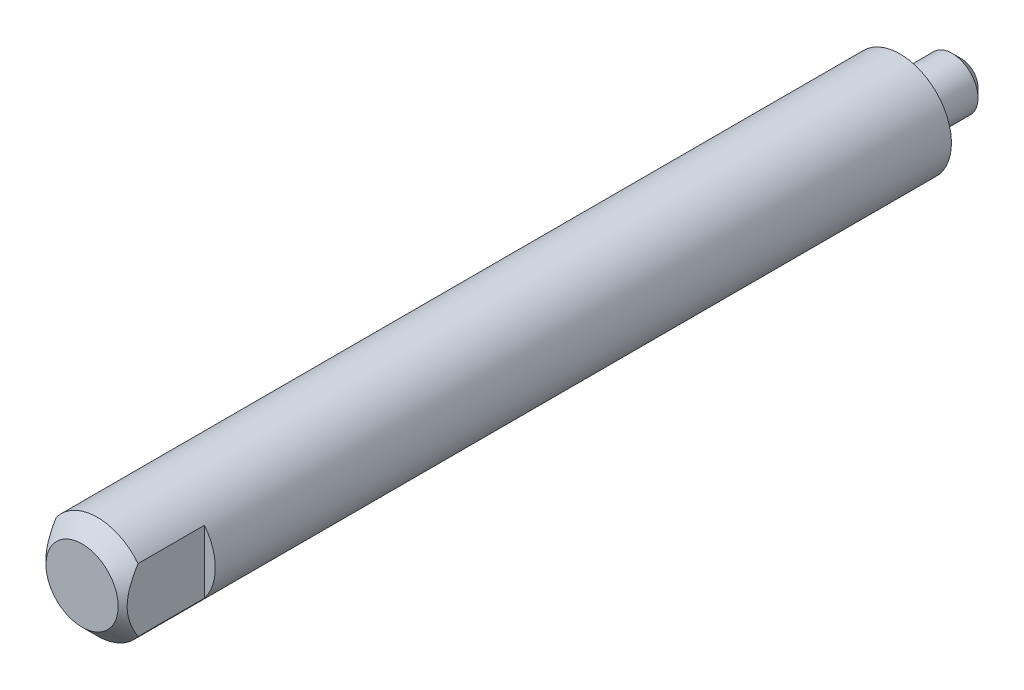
ISO-10303-21;
HEADER;
FILE_DESCRIPTION(('STEP AP214'),'2;1');
FILE_NAME('part.step','',(''),(''),'','','');
FILE_SCHEMA(('AUTOMOTIVE_DESIGN { 1 0 10303 214 1 1 1 1 }'));
ENDSEC;
DATA;
#1=APPLICATION_CONTEXT('core data for automotive mechanical design processes');
#2=APPLICATION_PROTOCOL_DEFINITION('international standard','automotive_design',2000,#1);
#3=PRODUCT_CONTEXT('',#1,'mechanical');
#4=PRODUCT('Part','Part','',(#3));
#5=PRODUCT_RELATED_PRODUCT_CATEGORY('part','',(#4));
#6=PRODUCT_DEFINITION_FORMATION('','',#4);
#7=PRODUCT_DEFINITION_CONTEXT('part definition',#1,'design');
#8=PRODUCT_DEFINITION('design','',#6,#7);
#9=PRODUCT_DEFINITION_SHAPE('','',#8);
#10=(LENGTH_UNIT() NAMED_UNIT(*) SI_UNIT(.MILLI.,.METRE.));
#11=(NAMED_UNIT(*) PLANE_ANGLE_UNIT() SI_UNIT($,.RADIAN.));
#12=(NAMED_UNIT(*) SI_UNIT($,.STERADIAN.) SOLID_ANGLE_UNIT());
#13=UNCERTAINTY_MEASURE_WITH_UNIT(LENGTH_MEASURE(1.E-05),#10,'distance_accuracy_value','');
#14=(GEOMETRIC_REPRESENTATION_CONTEXT(3) GLOBAL_UNCERTAINTY_ASSIGNED_CONTEXT((#13)) GLOBAL_UNIT_ASSIGNED_CONTEXT((#10,
#11,#12)) REPRESENTATION_CONTEXT('',''));
#15=CARTESIAN_POINT('',(0.,0.,0.));
#16=DIRECTION('',(0.,0.,1.));
#17=DIRECTION('',(1.,0.,0.));
#18=AXIS2_PLACEMENT_3D('',#15,#16,#17);
#19=CARTESIAN_POINT('',(0.0303893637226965,0.,80.));
#20=DIRECTION('',(0.,0.,-1.));
#21=DIRECTION('',(0.,-1.,0.));
#22=AXIS2_PLACEMENT_3D('',#19,#20,#21);
#23=CONICAL_SURFACE('',#22,3.5303893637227,0.78539816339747);
#24=CARTESIAN_POINT('',(0.0303893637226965,0.,80.));
#25=DIRECTION('',(0.,0.,-1.));
#26=DIRECTION('',(0.,-1.,0.));
#27=AXIS2_PLACEMENT_3D('',#24,#25,#26);
#28=CIRCLE('',#27,3.5303893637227);
#29=CARTESIAN_POINT('',(0.0303893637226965,-3.5303893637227,80.));
#30=VERTEX_POINT('',#29);
#31=EDGE_CURVE('E112',#30,#30,#28,.T.);
#32=ORIENTED_EDGE('',*,*,#31,.T.);
#33=EDGE_LOOP('',(#32));
#34=FACE_BOUND('',#33,.T.);
#35=CARTESIAN_POINT('',(4.,7.33813034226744,75.1873703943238));
#36=CARTESIAN_POINT('',(4.,7.16528585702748,75.3393697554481));
#37=CARTESIAN_POINT('',(4.,6.9918602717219,75.4907153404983));
#38=CARTESIAN_POINT('',(4.,6.64353602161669,75.7917470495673));
#39=CARTESIAN_POINT('',(4.,6.46863716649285,75.9414329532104));
#40=CARTESIAN_POINT('',(4.,6.11613508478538,76.2395700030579));
#41=CARTESIAN_POINT('',(4.,5.93852227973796,76.3880098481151));
#42=CARTESIAN_POINT('',(4.,5.58115163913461,76.6822677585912));
#43=CARTESIAN_POINT('',(4.,5.40139393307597,76.8280859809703));
#44=CARTESIAN_POINT('',(4.,5.0262482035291,77.126705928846));
#45=CARTESIAN_POINT('',(4.,4.83066252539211,77.2792602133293));
#46=CARTESIAN_POINT('',(4.,4.435561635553,77.5792996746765));
#47=CARTESIAN_POINT('',(4.,4.23604568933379,77.7267838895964));
#48=CARTESIAN_POINT('',(4.,3.83248423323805,78.0144361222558));
#49=CARTESIAN_POINT('',(4.,3.62845042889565,78.1546204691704));
#50=CARTESIAN_POINT('',(4.,3.21402508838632,78.4251895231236));
#51=CARTESIAN_POINT('',(4.,3.00363658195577,78.555578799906));
#52=CARTESIAN_POINT('',(4.,2.64334730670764,78.7626930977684));
#53=CARTESIAN_POINT('',(4.,2.49565075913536,78.8432321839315));
#54=CARTESIAN_POINT('',(4.,2.1958076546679,78.9957779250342));
#55=CARTESIAN_POINT('',(4.,2.04365981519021,79.0677820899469));
#56=CARTESIAN_POINT('',(4.,1.73620810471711,79.1998951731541));
#57=CARTESIAN_POINT('',(4.,1.58095751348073,79.2601264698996));
#58=CARTESIAN_POINT('',(4.,1.26569016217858,79.3665170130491));
#59=CARTESIAN_POINT('',(4.,1.10567636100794,79.4126848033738));
#60=CARTESIAN_POINT('',(4.,0.827710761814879,79.476973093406));
#61=CARTESIAN_POINT('',(4.,0.710741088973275,79.4993361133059));
#62=CARTESIAN_POINT('',(4.,0.475325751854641,79.5341149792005));
#63=CARTESIAN_POINT('',(4.,0.356880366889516,79.5465326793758));
#64=CARTESIAN_POINT('',(4.,0.119558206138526,79.5607419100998));
#65=CARTESIAN_POINT('',(4.,0.000682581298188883,79.5625524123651));
#66=CARTESIAN_POINT('',(4.,-0.236754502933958,79.5554960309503));
#67=CARTESIAN_POINT('',(4.,-0.355315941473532,79.5466284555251));
#68=CARTESIAN_POINT('',(4.,-0.590194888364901,79.5188251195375));
#69=CARTESIAN_POINT('',(4.,-0.706522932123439,79.4999769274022));
#70=CARTESIAN_POINT('',(4.,-0.937319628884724,79.4531848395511));
#71=CARTESIAN_POINT('',(4.,-1.05178812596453,79.425240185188));
#72=CARTESIAN_POINT('',(4.,-1.27960221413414,79.3610830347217));
#73=CARTESIAN_POINT('',(4.,-1.39292493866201,79.3247902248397));
#74=CARTESIAN_POINT('',(4.,-1.61707609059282,79.2453265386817));
#75=CARTESIAN_POINT('',(4.,-1.72790506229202,79.202157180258));
#76=CARTESIAN_POINT('',(4.,-2.01082785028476,79.0833159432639));
#77=CARTESIAN_POINT('',(4.,-2.18110670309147,79.0033319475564));
#78=CARTESIAN_POINT('',(4.,-2.51626466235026,78.8326686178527));
#79=CARTESIAN_POINT('',(4.,-2.68113979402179,78.7419816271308));
#80=CARTESIAN_POINT('',(4.,-3.00688630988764,78.5522790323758));
#81=CARTESIAN_POINT('',(4.,-3.16773873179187,78.4532311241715));
#82=CARTESIAN_POINT('',(4.,-3.48549889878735,78.2491304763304));
#83=CARTESIAN_POINT('',(4.,-3.64240766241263,78.1440793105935));
#84=CARTESIAN_POINT('',(4.,-3.94420672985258,77.9354467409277));
#85=CARTESIAN_POINT('',(4.,-4.08927393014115,77.8321199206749));
#86=CARTESIAN_POINT('',(4.,-4.3770427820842,77.622205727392));
#87=CARTESIAN_POINT('',(4.,-4.51974421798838,77.5156180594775));
#88=CARTESIAN_POINT('',(4.,-4.80180621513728,77.3008747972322));
#89=CARTESIAN_POINT('',(4.,-4.94118567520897,77.1927439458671));
#90=CARTESIAN_POINT('',(4.,-5.21825792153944,76.9744112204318));
#91=CARTESIAN_POINT('',(4.,-5.35595112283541,76.8642098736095));
#92=CARTESIAN_POINT('',(4.,-5.49296670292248,76.7531855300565));
#93=B_SPLINE_CURVE_WITH_KNOTS('',3,(#35,#36,#37,#38,#39,#40,#41,#42,#43,#44,#45,#46,#47,#48,#49,
#50,#51,#52,#53,#54,#55,#56,#57,#58,#59,#60,#61,#62,#63,#64,#65,#66,#67,#68,#69,#70,#71,#72,#73,
#74,#75,#76,#77,#78,#79,#80,#81,#82,#83,#84,#85,#86,#87,#88,#89,#90,#91,#92),.UNSPECIFIED.,.F.,
.F.,(4,2,2,2,2,2,2,2,2,2,2,2,2,2,2,2,2,2,2,2,2,2,2,2,2,2,2,2,4),(0.,0.690520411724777,
1.38113143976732,2.07553650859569,2.76989986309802,3.51397533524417,4.25819121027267,
5.00066372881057,5.74278767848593,6.24726681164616,6.75189276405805,7.25095592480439,
7.74971528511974,8.10660603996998,8.46343024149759,8.81961604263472,9.17582491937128,
9.52895903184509,9.88212260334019,10.2388375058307,10.5954737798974,11.1593067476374,
11.7235455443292,12.2900740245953,12.8564546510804,13.3907111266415,13.925016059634,
14.4542112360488,14.9832734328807),.UNSPECIFIED.);
#94=CARTESIAN_POINT('',(4.,3.08982338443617,78.5));
#95=VERTEX_POINT('',#94);
#96=CARTESIAN_POINT('',(4.,-3.08982338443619,78.5));
#97=VERTEX_POINT('',#96);
#98=EDGE_CURVE('E64',#95,#97,#93,.T.);
#99=ORIENTED_EDGE('',*,*,#98,.F.);
#100=CARTESIAN_POINT('',(0.0303893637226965,0.,78.5));
#101=DIRECTION('',(0.,0.,-1.));
#102=DIRECTION('',(0.,-1.,0.));
#103=AXIS2_PLACEMENT_3D('',#100,#101,#102);
#104=CIRCLE('',#103,5.03038936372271);
#105=CARTESIAN_POINT('',(-4.,3.0101127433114,78.5));
#106=VERTEX_POINT('',#105);
#107=EDGE_CURVE('E110',#106,#95,#104,.T.);
#108=ORIENTED_EDGE('',*,*,#107,.F.);
#109=CARTESIAN_POINT('',(-4.,7.36644510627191,75.1334523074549));
#110=CARTESIAN_POINT('',(-4.,7.19226264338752,75.2862313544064));
#111=CARTESIAN_POINT('',(-4.,7.01748363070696,75.4383376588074));
#112=CARTESIAN_POINT('',(-4.,6.66641297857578,75.7408422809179));
#113=CARTESIAN_POINT('',(-4.,6.49012113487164,75.891240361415));
#114=CARTESIAN_POINT('',(-4.,6.1347280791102,76.1907877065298));
#115=CARTESIAN_POINT('',(-4.,5.95561651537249,76.339924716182));
#116=CARTESIAN_POINT('',(-4.,5.59519131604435,76.6354958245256));
#117=CARTESIAN_POINT('',(-4.,5.41387781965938,76.7819300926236));
#118=CARTESIAN_POINT('',(-4.,5.03480962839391,77.0822145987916));
#119=CARTESIAN_POINT('',(-4.,4.83684199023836,77.2357969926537));
#120=CARTESIAN_POINT('',(-4.,4.43684562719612,77.5376941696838));
#121=CARTESIAN_POINT('',(-4.,4.23481609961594,77.6860078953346));
#122=CARTESIAN_POINT('',(-4.,3.82609576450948,77.9750140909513));
#123=CARTESIAN_POINT('',(-4.,3.61941770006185,78.1157244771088));
#124=CARTESIAN_POINT('',(-4.,3.19950883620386,78.3869335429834));
#125=CARTESIAN_POINT('',(-4.,2.98628134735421,78.5174372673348));
#126=CARTESIAN_POINT('',(-4.,2.62183643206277,78.7237843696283));
#127=CARTESIAN_POINT('',(-4.,2.47290359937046,78.8036410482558));
#128=CARTESIAN_POINT('',(-4.,2.17054389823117,78.9545703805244));
#129=CARTESIAN_POINT('',(-4.,2.01711577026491,79.0256405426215));
#130=CARTESIAN_POINT('',(-4.,1.70721835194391,79.1555652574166));
#131=CARTESIAN_POINT('',(-4.,1.55080567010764,79.2145530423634));
#132=CARTESIAN_POINT('',(-4.,1.23328290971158,79.3181952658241));
#133=CARTESIAN_POINT('',(-4.,1.07217566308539,79.3628581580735));
#134=CARTESIAN_POINT('',(-4.,0.791167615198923,79.4246941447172));
#135=CARTESIAN_POINT('',(-4.,0.672188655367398,79.4460534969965));
#136=CARTESIAN_POINT('',(-4.,0.432841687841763,79.4785562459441));
#137=CARTESIAN_POINT('',(-4.,0.312473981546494,79.4897018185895));
#138=CARTESIAN_POINT('',(-4.,0.0714376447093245,79.501161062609));
#139=CARTESIAN_POINT('',(-4.,-0.0492300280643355,79.5014945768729));
#140=CARTESIAN_POINT('',(-4.,-0.290119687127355,79.491365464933));
#141=CARTESIAN_POINT('',(-4.,-0.410341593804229,79.4809009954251));
#142=CARTESIAN_POINT('',(-4.,-0.674613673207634,79.4464489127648));
#143=CARTESIAN_POINT('',(-4.,-0.818353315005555,79.4200785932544));
#144=CARTESIAN_POINT('',(-4.,-1.10275410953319,79.3541563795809));
#145=CARTESIAN_POINT('',(-4.,-1.24341419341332,79.3145999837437));
#146=CARTESIAN_POINT('',(-4.,-1.52331578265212,79.2237997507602));
#147=CARTESIAN_POINT('',(-4.,-1.66250017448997,79.172381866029));
#148=CARTESIAN_POINT('',(-4.,-1.86841050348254,79.0884223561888));
#149=CARTESIAN_POINT('',(-4.,-1.93656399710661,79.059299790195));
#150=CARTESIAN_POINT('',(-4.,-2.07195883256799,78.9990121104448));
#151=CARTESIAN_POINT('',(-4.,-2.13920021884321,78.9678470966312));
#152=CARTESIAN_POINT('',(-4.,-2.3482787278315,78.8674660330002));
#153=CARTESIAN_POINT('',(-4.,-2.48857663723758,78.7950351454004));
#154=CARTESIAN_POINT('',(-4.,-2.76567007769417,78.6437239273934));
#155=CARTESIAN_POINT('',(-4.,-2.90246437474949,78.5648413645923));
#156=CARTESIAN_POINT('',(-4.,-3.17316533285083,78.4019079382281));
#157=CARTESIAN_POINT('',(-4.,-3.30706804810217,78.3178505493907));
#158=CARTESIAN_POINT('',(-4.,-3.57222979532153,78.1457166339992));
#159=CARTESIAN_POINT('',(-4.,-3.7034891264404,78.0576405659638));
#160=CARTESIAN_POINT('',(-4.,-3.96459211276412,77.8776888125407));
#161=CARTESIAN_POINT('',(-4.,-4.09442162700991,77.7857926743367));
#162=CARTESIAN_POINT('',(-4.,-4.3521559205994,77.5993350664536));
#163=CARTESIAN_POINT('',(-4.,-4.4800606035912,77.5047734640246));
#164=CARTESIAN_POINT('',(-4.,-4.8611399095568,77.2179721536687));
#165=CARTESIAN_POINT('',(-4.,-5.1118689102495,77.0224834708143));
#166=CARTESIAN_POINT('',(-4.,-5.57982109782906,76.6484461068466));
#167=CARTESIAN_POINT('',(-4.,-5.79756949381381,76.4705486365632));
#168=CARTESIAN_POINT('',(-4.,-6.23016750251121,76.1111896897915));
#169=CARTESIAN_POINT('',(-4.,-6.44501659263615,75.9297275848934));
#170=CARTESIAN_POINT('',(-4.,-6.8695732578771,75.5665256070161));
#171=CARTESIAN_POINT('',(-4.,-7.07931124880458,75.3848211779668));
#172=CARTESIAN_POINT('',(-4.,-7.49689745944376,75.0193668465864));
#173=CARTESIAN_POINT('',(-4.,-7.70474618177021,74.8356175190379));
#174=CARTESIAN_POINT('',(-4.,-7.91188936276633,74.6510858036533));
#175=B_SPLINE_CURVE_WITH_KNOTS('',3,(#109,#110,#111,#112,#113,#114,#115,#116,#117,#118,#119,
#120,#121,#122,#123,#124,#125,#126,#127,#128,#129,#130,#131,#132,#133,#134,#135,#136,#137,#138,
#139,#140,#141,#142,#143,#144,#145,#146,#147,#148,#149,#150,#151,#152,#153,#154,#155,#156,#157,
#158,#159,#160,#161,#162,#163,#164,#165,#166,#167,#168,#169,#170,#171,#172,#173,#174),
.UNSPECIFIED.,.F.,.F.,(4,2,2,2,2,2,2,2,2,2,2,2,2,2,2,2,2,2,2,2,2,2,2,2,2,2,2,2,2,2,2,2,4),(0.,
0.695080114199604,1.39025559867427,2.08945204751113,2.78860452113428,3.54021020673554,
4.29196591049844,5.04186515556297,5.79139139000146,6.29814904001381,6.80505006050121,
7.30601849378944,7.80669073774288,8.16894371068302,8.53111949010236,8.89263054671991,
9.25420332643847,9.69187797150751,10.1297021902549,10.5744130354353,10.7967313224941,
11.019038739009,11.4924726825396,11.9660711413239,12.4402795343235,12.914433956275,
13.3915774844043,13.8687448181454,14.8223871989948,15.6658868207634,16.5095365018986,
17.342023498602,18.174282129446),.UNSPECIFIED.);
#176=CARTESIAN_POINT('',(-4.,-3.01011274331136,78.5));
#177=VERTEX_POINT('',#176);
#178=EDGE_CURVE('E88',#177,#106,#175,.F.);
#179=ORIENTED_EDGE('',*,*,#178,.F.);
#180=EDGE_CURVE('E109',#97,#177,#104,.T.);
#181=ORIENTED_EDGE('',*,*,#180,.F.);
#182=EDGE_LOOP('',(#99,#108,#179,#181));
#183=FACE_BOUND('',#182,.T.);
#184=ADVANCED_FACE('F14',(#34,#183),#23,.T.);
#185=CARTESIAN_POINT('',(0.0303893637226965,0.,-8.08262108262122));
#186=DIRECTION('',(0.,0.,-1.));
#187=DIRECTION('',(0.,-1.,0.));
#188=AXIS2_PLACEMENT_3D('',#185,#186,#187);
#189=CYLINDRICAL_SURFACE('',#188,5.0303893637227);
#190=CARTESIAN_POINT('',(0.0303893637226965,0.,0.));
#191=DIRECTION('',(0.,0.,-1.));
#192=DIRECTION('',(0.,-1.,0.));
#193=AXIS2_PLACEMENT_3D('',#190,#191,#192);
#194=CIRCLE('',#193,5.03038936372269);
#195=CARTESIAN_POINT('',(0.0303893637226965,-5.03038936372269,0.));
#196=VERTEX_POINT('',#195);
#197=EDGE_CURVE('E106',#196,#196,#194,.T.);
#198=ORIENTED_EDGE('',*,*,#197,.F.);
#199=EDGE_LOOP('',(#198));
#200=FACE_BOUND('',#199,.T.);
#201=CARTESIAN_POINT('',(0.0303893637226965,0.,72.));
#202=DIRECTION('',(0.,0.,-1.));
#203=DIRECTION('',(0.,-1.,0.));
#204=AXIS2_PLACEMENT_3D('',#201,#202,#203);
#205=CIRCLE('',#204,5.0303893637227);
#206=CARTESIAN_POINT('',(4.,3.08982338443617,72.));
#207=VERTEX_POINT('',#206);
#208=CARTESIAN_POINT('',(4.,-3.08982338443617,72.));
#209=VERTEX_POINT('',#208);
#210=EDGE_CURVE('E22',#207,#209,#205,.T.);
#211=ORIENTED_EDGE('',*,*,#210,.T.);
#212=DIRECTION('',(0.,0.,-1.));
#213=VECTOR('',#212,1.);
#214=CARTESIAN_POINT('',(4.,-3.08982338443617,-8.08262108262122));
#215=LINE('',#214,#213);
#216=EDGE_CURVE('E9',#97,#209,#215,.T.);
#217=ORIENTED_EDGE('',*,*,#216,.F.);
#218=ORIENTED_EDGE('',*,*,#180,.T.);
#219=DIRECTION('',(0.,0.,-1.));
#220=VECTOR('',#219,1.);
#221=CARTESIAN_POINT('',(-4.,-3.01011274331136,-8.08262108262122));
#222=LINE('',#221,#220);
#223=CARTESIAN_POINT('',(-4.,-3.01011274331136,72.));
#224=VERTEX_POINT('',#223);
#225=EDGE_CURVE('E115',#224,#177,#222,.F.);
#226=ORIENTED_EDGE('',*,*,#225,.F.);
#227=CARTESIAN_POINT('',(0.0303893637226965,0.,72.));
#228=DIRECTION('',(0.,0.,1.));
#229=DIRECTION('',(0.,1.,0.));
#230=AXIS2_PLACEMENT_3D('',#227,#228,#229);
#231=CIRCLE('',#230,5.0303893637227);
#232=CARTESIAN_POINT('',(-4.,3.01011274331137,72.));
#233=VERTEX_POINT('',#232);
#234=EDGE_CURVE('E117',#233,#224,#231,.T.);
#235=ORIENTED_EDGE('',*,*,#234,.F.);
#236=DIRECTION('',(0.,0.,-1.));
#237=VECTOR('',#236,1.);
#238=CARTESIAN_POINT('',(-4.,3.01011274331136,-8.08262108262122));
#239=LINE('',#238,#237);
#240=EDGE_CURVE('E119',#106,#233,#239,.T.);
#241=ORIENTED_EDGE('',*,*,#240,.F.);
#242=ORIENTED_EDGE('',*,*,#107,.T.);
#243=DIRECTION('',(0.,0.,-1.));
#244=VECTOR('',#243,1.);
#245=CARTESIAN_POINT('',(4.,3.08982338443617,-8.08262108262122));
#246=LINE('',#245,#244);
#247=EDGE_CURVE('E60',#207,#95,#246,.F.);
#248=ORIENTED_EDGE('',*,*,#247,.F.);
#249=EDGE_LOOP('',(#211,#217,#218,#226,#235,#241,#242,#248));
#250=FACE_BOUND('',#249,.T.);
#251=ADVANCED_FACE('F57',(#200,#250),#189,.T.);
#252=CARTESIAN_POINT('',(-3.5,0.,80.));
#253=DIRECTION('',(0.,0.,-1.));
#254=DIRECTION('',(0.,-1.,0.));
#255=AXIS2_PLACEMENT_3D('',#252,#253,#254);
#256=PLANE('',#255);
#257=ORIENTED_EDGE('',*,*,#31,.F.);
#258=EDGE_LOOP('',(#257));
#259=FACE_BOUND('',#258,.T.);
#260=ADVANCED_FACE('F16',(#259),#256,.F.);
#261=CARTESIAN_POINT('',(-2.79999999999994,0.,0.));
#262=DIRECTION('',(0.,0.,1.));
#263=DIRECTION('',(0.,1.,0.));
#264=AXIS2_PLACEMENT_3D('',#261,#262,#263);
#265=PLANE('',#264);
#266=CARTESIAN_POINT('',(0.0303893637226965,0.,0.));
#267=DIRECTION('',(0.,0.,-1.));
#268=DIRECTION('',(0.,-1.,0.));
#269=AXIS2_PLACEMENT_3D('',#266,#267,#268);
#270=CIRCLE('',#269,2.83038936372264);
#271=CARTESIAN_POINT('',(0.0303893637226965,-2.83038936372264,0.));
#272=VERTEX_POINT('',#271);
#273=EDGE_CURVE('E103',#272,#272,#270,.T.);
#274=ORIENTED_EDGE('',*,*,#273,.F.);
#275=EDGE_LOOP('',(#274));
#276=FACE_BOUND('',#275,.T.);
#277=ORIENTED_EDGE('',*,*,#197,.T.);
#278=EDGE_LOOP('',(#277));
#279=FACE_BOUND('',#278,.T.);
#280=ADVANCED_FACE('F146',(#276,#279),#265,.F.);
#281=CARTESIAN_POINT('',(0.0303893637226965,0.,-0.300000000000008));
#282=DIRECTION('',(0.,0.,-1.));
#283=DIRECTION('',(0.,-1.,0.));
#284=AXIS2_PLACEMENT_3D('',#281,#282,#283);
#285=TOROIDAL_SURFACE('',#284,2.83038936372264,0.299999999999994);
#286=CARTESIAN_POINT('',(0.0303893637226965,0.,-0.300000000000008));
#287=DIRECTION('',(0.,0.,-1.));
#288=DIRECTION('',(0.,-1.,0.));
#289=AXIS2_PLACEMENT_3D('',#286,#287,#288);
#290=CIRCLE('',#289,2.53038936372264);
#291=CARTESIAN_POINT('',(0.0303893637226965,-2.53038936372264,-0.300000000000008));
#292=VERTEX_POINT('',#291);
#293=EDGE_CURVE('E100',#292,#292,#290,.T.);
#294=ORIENTED_EDGE('',*,*,#293,.F.);
#295=EDGE_LOOP('',(#294));
#296=FACE_BOUND('',#295,.T.);
#297=ORIENTED_EDGE('',*,*,#273,.T.);
#298=EDGE_LOOP('',(#297));
#299=FACE_BOUND('',#298,.T.);
#300=ADVANCED_FACE('F151',(#296,#299),#285,.F.);
#301=CARTESIAN_POINT('',(0.0303893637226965,0.,-8.08262108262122));
#302=DIRECTION('',(0.,0.,-1.));
#303=DIRECTION('',(0.,-1.,0.));
#304=AXIS2_PLACEMENT_3D('',#301,#302,#303);
#305=CYLINDRICAL_SURFACE('',#304,2.53038936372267);
#306=CARTESIAN_POINT('',(0.0303893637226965,0.,-5.10000000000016));
#307=DIRECTION('',(0.,0.,-1.));
#308=DIRECTION('',(0.,-1.,0.));
#309=AXIS2_PLACEMENT_3D('',#306,#307,#308);
#310=CIRCLE('',#309,2.5303893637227);
#311=CARTESIAN_POINT('',(0.0303893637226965,-2.5303893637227,-5.10000000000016));
#312=VERTEX_POINT('',#311);
#313=EDGE_CURVE('E97',#312,#312,#310,.T.);
#314=ORIENTED_EDGE('',*,*,#313,.F.);
#315=EDGE_LOOP('',(#314));
#316=FACE_BOUND('',#315,.T.);
#317=ORIENTED_EDGE('',*,*,#293,.T.);
#318=EDGE_LOOP('',(#317));
#319=FACE_BOUND('',#318,.T.);
#320=ADVANCED_FACE('F158',(#316,#319),#305,.T.);
#321=CARTESIAN_POINT('',(0.0303893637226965,0.,-5.10000000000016));
#322=DIRECTION('',(0.,0.,1.));
#323=DIRECTION('',(0.,1.,0.));
#324=AXIS2_PLACEMENT_3D('',#321,#322,#323);
#325=CONICAL_SURFACE('',#324,2.5303893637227,0.785398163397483);
#326=CARTESIAN_POINT('',(0.0303893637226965,0.,-6.00000000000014));
#327=DIRECTION('',(0.,0.,-1.));
#328=DIRECTION('',(0.,-1.,0.));
#329=AXIS2_PLACEMENT_3D('',#326,#327,#328);
#330=CIRCLE('',#329,1.63038936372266);
#331=CARTESIAN_POINT('',(0.0303893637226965,-1.63038936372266,-6.00000000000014));
#332=VERTEX_POINT('',#331);
#333=EDGE_CURVE('E94',#332,#332,#330,.T.);
#334=ORIENTED_EDGE('',*,*,#333,.F.);
#335=EDGE_LOOP('',(#334));
#336=FACE_BOUND('',#335,.T.);
#337=ORIENTED_EDGE('',*,*,#313,.T.);
#338=EDGE_LOOP('',(#337));
#339=FACE_BOUND('',#338,.T.);
#340=ADVANCED_FACE('F134',(#336,#339),#325,.T.);
#341=CARTESIAN_POINT('',(0.0303893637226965,0.,-6.00000000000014));
#342=DIRECTION('',(0.,0.,1.));
#343=DIRECTION('',(0.,1.,0.));
#344=AXIS2_PLACEMENT_3D('',#341,#342,#343);
#345=PLANE('',#344);
#346=ORIENTED_EDGE('',*,*,#333,.T.);
#347=EDGE_LOOP('',(#346));
#348=FACE_BOUND('',#347,.T.);
#349=ADVANCED_FACE('F128',(#348),#345,.F.);
#350=CARTESIAN_POINT('',(-5.,-8.,72.));
#351=DIRECTION('',(0.,0.,1.));
#352=DIRECTION('',(0.,1.,0.));
#353=AXIS2_PLACEMENT_3D('',#350,#351,#352);
#354=PLANE('',#353);
#355=DIRECTION('',(0.,-1.,0.));
#356=VECTOR('',#355,1.);
#357=CARTESIAN_POINT('',(-4.,-8.,72.));
#358=LINE('',#357,#356);
#359=EDGE_CURVE('E36',#233,#224,#358,.T.);
#360=ORIENTED_EDGE('',*,*,#359,.F.);
#361=ORIENTED_EDGE('',*,*,#234,.T.);
#362=EDGE_LOOP('',(#360,#361));
#363=FACE_BOUND('',#362,.T.);
#364=ADVANCED_FACE('F86',(#363),#354,.T.);
#365=CARTESIAN_POINT('',(-4.,9.,83.));
#366=DIRECTION('',(-1.,0.,0.));
#367=DIRECTION('',(0.,-1.,0.));
#368=AXIS2_PLACEMENT_3D('',#365,#366,#367);
#369=PLANE('',#368);
#370=ORIENTED_EDGE('',*,*,#240,.T.);
#371=ORIENTED_EDGE('',*,*,#359,.T.);
#372=ORIENTED_EDGE('',*,*,#225,.T.);
#373=ORIENTED_EDGE('',*,*,#178,.T.);
#374=EDGE_LOOP('',(#370,#371,#372,#373));
#375=FACE_BOUND('',#374,.T.);
#376=ADVANCED_FACE('F82',(#375),#369,.T.);
#377=CARTESIAN_POINT('',(5.06077872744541,-8.,72.));
#378=DIRECTION('',(0.,0.,-1.));
#379=DIRECTION('',(0.,-1.,0.));
#380=AXIS2_PLACEMENT_3D('',#377,#378,#379);
#381=PLANE('',#380);
#382=DIRECTION('',(0.,-1.,0.));
#383=VECTOR('',#382,1.);
#384=CARTESIAN_POINT('',(4.,-8.,72.));
#385=LINE('',#384,#383);
#386=EDGE_CURVE('E28',#207,#209,#385,.T.);
#387=ORIENTED_EDGE('',*,*,#386,.T.);
#388=ORIENTED_EDGE('',*,*,#210,.F.);
#389=EDGE_LOOP('',(#387,#388));
#390=FACE_BOUND('',#389,.T.);
#391=ADVANCED_FACE('F65',(#390),#381,.F.);
#392=CARTESIAN_POINT('',(4.,9.,83.));
#393=DIRECTION('',(1.,0.,0.));
#394=DIRECTION('',(0.,-1.,0.));
#395=AXIS2_PLACEMENT_3D('',#392,#393,#394);
#396=PLANE('',#395);
#397=ORIENTED_EDGE('',*,*,#216,.T.);
#398=ORIENTED_EDGE('',*,*,#386,.F.);
#399=ORIENTED_EDGE('',*,*,#247,.T.);
#400=ORIENTED_EDGE('',*,*,#98,.T.);
#401=EDGE_LOOP('',(#397,#398,#399,#400));
#402=FACE_BOUND('',#401,.T.);
#403=ADVANCED_FACE('F62',(#402),#396,.T.);
#404=CLOSED_SHELL('',(#184,#251,#260,#280,#300,#320,#340,#349,#364,#376,#391,#403));
#405=MANIFOLD_SOLID_BREP('B1',#404);
#406=ADVANCED_BREP_SHAPE_REPRESENTATION('',(#18,#405),#14);
#407=SHAPE_DEFINITION_REPRESENTATION(#9,#406);
ENDSEC;
END-ISO-10303-21;
